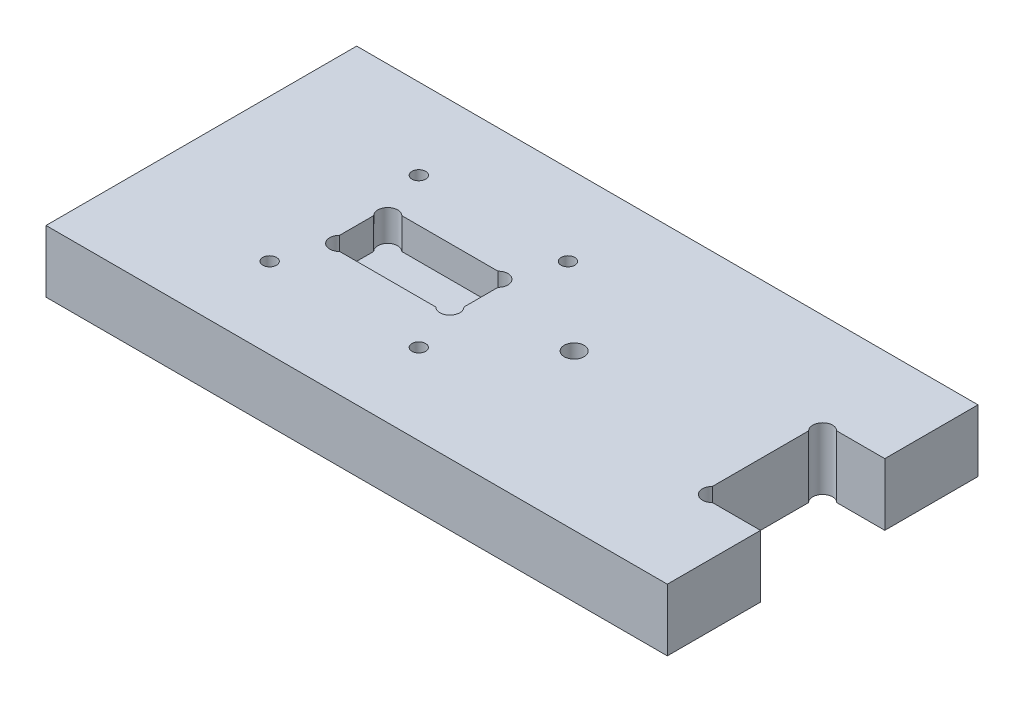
from build123d import *

# Parameters (mm, degrees)
ESQUISSE1_R             = 1.1
ESQUISSE1_R_2           = 1.6
BOSS_EXTRU_1_DEPTH      = 10
ENL_V_MAT_EXTRU_1_DEPTH = 5


with BuildPart() as part:
    # Esquisse1 → Boss.-Extru.1 (new body)
    with BuildSketch(Plane(origin=(0, 0, 0), x_dir=(1, 0, 0), z_dir=(0, 1, 0))):
        with BuildLine():
            Line((0, 50), (0, 0))
            Line((0, 0), (100, 0))
            Line((100, 0), (100, 15))
            Line((100, 15), (92.2627417, 15))
            ThreePointArc((92.2627417, 15), (90, 15), (90, 17.2627417))
            Line((90, 17.2627417), (90, 32.7372583))
            ThreePointArc((90, 32.7372583), (90, 35), (92.2627417, 35))
            Line((92.2627417, 35), (100, 35))
            Line((100, 35), (100, 50))
            Line((100, 50), (0, 50))
        make_face()
        with Locations(Location((23, 13, 0), (0, 0, 270))):
            Circle(ESQUISSE1_R, mode=Mode.SUBTRACT)
        with Locations(Location((47, 13, 0), (0, 0, 90))):
            Circle(ESQUISSE1_R, mode=Mode.SUBTRACT)
        with Locations(Location((47, 37, 0), (0, 0, 270))):
            Circle(ESQUISSE1_R, mode=Mode.SUBTRACT)
        with Locations(Location((23, 37, 0), (0, 0, 90))):
            Circle(ESQUISSE1_R, mode=Mode.SUBTRACT)
        with Locations(Location((60, 25, 0), (0, 0, 270))):
            Circle(ESQUISSE1_R_2, mode=Mode.SUBTRACT)
    extrude(amount=BOSS_EXTRU_1_DEPTH)

    # Esquisse2 → Enl_v. mat.-Extru.1 (cut)
    with BuildSketch(Plane(origin=(0, 10, 0), x_dir=(1, 0, 0), z_dir=(0, 1, 0))):
        with BuildLine():
            Line((25, 27.7372583), (25, 22.2627417))
            ThreePointArc((25, 22.2627417), (25, 20), (27.2627417, 20))
            Line((27.2627417, 20), (42.7372583, 20))
            ThreePointArc((42.7372583, 20), (45, 20), (45, 22.2627417))
            Line((45, 22.2627417), (45, 27.7372583))
            ThreePointArc((45, 27.7372583), (45, 30), (42.7372583, 30))
            Line((42.7372583, 30), (27.2627417, 30))
            ThreePointArc((27.2627417, 30), (25, 30), (25, 27.7372583))
        make_face()
    extrude(amount=-ENL_V_MAT_EXTRU_1_DEPTH, mode=Mode.SUBTRACT)


solid = part.part
